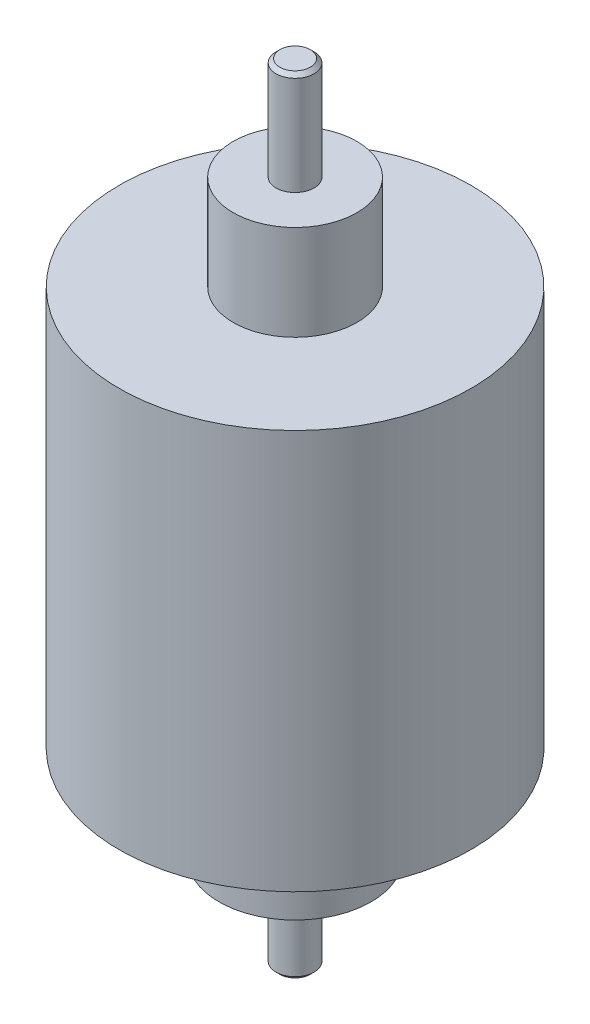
ISO-10303-21;
HEADER;
FILE_DESCRIPTION(('STEP AP214'),'2;1');
FILE_NAME('part.step','',(''),(''),'','','');
FILE_SCHEMA(('AUTOMOTIVE_DESIGN { 1 0 10303 214 1 1 1 1 }'));
ENDSEC;
DATA;
#1=APPLICATION_CONTEXT('core data for automotive mechanical design processes');
#2=APPLICATION_PROTOCOL_DEFINITION('international standard','automotive_design',2000,#1);
#3=PRODUCT_CONTEXT('',#1,'mechanical');
#4=PRODUCT('Part','Part','',(#3));
#5=PRODUCT_RELATED_PRODUCT_CATEGORY('part','',(#4));
#6=PRODUCT_DEFINITION_FORMATION('','',#4);
#7=PRODUCT_DEFINITION_CONTEXT('part definition',#1,'design');
#8=PRODUCT_DEFINITION('design','',#6,#7);
#9=PRODUCT_DEFINITION_SHAPE('','',#8);
#10=(LENGTH_UNIT() NAMED_UNIT(*) SI_UNIT(.MILLI.,.METRE.));
#11=(NAMED_UNIT(*) PLANE_ANGLE_UNIT() SI_UNIT($,.RADIAN.));
#12=(NAMED_UNIT(*) SI_UNIT($,.STERADIAN.) SOLID_ANGLE_UNIT());
#13=UNCERTAINTY_MEASURE_WITH_UNIT(LENGTH_MEASURE(1.E-05),#10,'distance_accuracy_value','');
#14=(GEOMETRIC_REPRESENTATION_CONTEXT(3) GLOBAL_UNCERTAINTY_ASSIGNED_CONTEXT((#13)) GLOBAL_UNIT_ASSIGNED_CONTEXT((#10,
#11,#12)) REPRESENTATION_CONTEXT('',''));
#15=CARTESIAN_POINT('',(0.,0.,0.));
#16=DIRECTION('',(0.,0.,1.));
#17=DIRECTION('',(1.,0.,0.));
#18=AXIS2_PLACEMENT_3D('',#15,#16,#17);
#19=CARTESIAN_POINT('',(0.,29.9994124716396,0.999999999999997));
#20=DIRECTION('',(0.,1.,0.));
#21=DIRECTION('',(0.,0.,1.));
#22=AXIS2_PLACEMENT_3D('',#19,#20,#21);
#23=PLANE('',#22);
#24=CARTESIAN_POINT('',(0.,29.9994124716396,0.));
#25=DIRECTION('',(0.,-1.,0.));
#26=DIRECTION('',(0.,0.,-1.));
#27=AXIS2_PLACEMENT_3D('',#24,#25,#26);
#28=CIRCLE('',#27,0.999999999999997);
#29=CARTESIAN_POINT('',(0.,29.9994124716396,-0.999999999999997));
#30=VERTEX_POINT('',#29);
#31=EDGE_CURVE('E52',#30,#30,#28,.T.);
#32=ORIENTED_EDGE('',*,*,#31,.T.);
#33=EDGE_LOOP('',(#32));
#34=FACE_BOUND('',#33,.T.);
#35=CARTESIAN_POINT('',(0.,29.9994124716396,0.));
#36=DIRECTION('',(0.,-1.,0.));
#37=DIRECTION('',(0.,0.,-1.));
#38=AXIS2_PLACEMENT_3D('',#35,#36,#37);
#39=CIRCLE('',#38,3.25);
#40=CARTESIAN_POINT('',(0.,29.9994124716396,-3.25));
#41=VERTEX_POINT('',#40);
#42=EDGE_CURVE('E83',#41,#41,#39,.T.);
#43=ORIENTED_EDGE('',*,*,#42,.F.);
#44=EDGE_LOOP('',(#43));
#45=FACE_BOUND('',#44,.T.);
#46=ADVANCED_FACE('F36',(#34,#45),#23,.T.);
#47=CARTESIAN_POINT('',(0.,-1.0005875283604,4.));
#48=DIRECTION('',(0.,-1.,0.));
#49=DIRECTION('',(0.,0.,-1.));
#50=AXIS2_PLACEMENT_3D('',#47,#48,#49);
#51=PLANE('',#50);
#52=CARTESIAN_POINT('',(0.,-1.0005875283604,0.));
#53=DIRECTION('',(0.,-1.,0.));
#54=DIRECTION('',(0.,0.,-1.));
#55=AXIS2_PLACEMENT_3D('',#52,#53,#54);
#56=CIRCLE('',#55,4.);
#57=CARTESIAN_POINT('',(0.,-1.0005875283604,-4.));
#58=VERTEX_POINT('',#57);
#59=EDGE_CURVE('E65',#58,#58,#56,.T.);
#60=ORIENTED_EDGE('',*,*,#59,.T.);
#61=EDGE_LOOP('',(#60));
#62=FACE_BOUND('',#61,.T.);
#63=CARTESIAN_POINT('',(0.,-1.0005875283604,0.));
#64=DIRECTION('',(0.,-1.,0.));
#65=DIRECTION('',(0.,0.,-1.));
#66=AXIS2_PLACEMENT_3D('',#63,#64,#65);
#67=CIRCLE('',#66,0.999999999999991);
#68=CARTESIAN_POINT('',(0.,-1.0005875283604,-0.999999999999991));
#69=VERTEX_POINT('',#68);
#70=EDGE_CURVE('E61',#69,#69,#67,.T.);
#71=ORIENTED_EDGE('',*,*,#70,.F.);
#72=EDGE_LOOP('',(#71));
#73=FACE_BOUND('',#72,.T.);
#74=ADVANCED_FACE('F91',(#62,#73),#51,.T.);
#75=CARTESIAN_POINT('',(0.,0.,0.));
#76=DIRECTION('',(0.,-1.,0.));
#77=DIRECTION('',(0.,0.,-1.));
#78=AXIS2_PLACEMENT_3D('',#75,#76,#77);
#79=CYLINDRICAL_SURFACE('',#78,4.);
#80=CARTESIAN_POINT('',(0.,3.9994124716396,0.));
#81=DIRECTION('',(0.,-1.,0.));
#82=DIRECTION('',(0.,0.,-1.));
#83=AXIS2_PLACEMENT_3D('',#80,#81,#82);
#84=CIRCLE('',#83,4.);
#85=CARTESIAN_POINT('',(0.,3.9994124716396,-4.));
#86=VERTEX_POINT('',#85);
#87=EDGE_CURVE('E69',#86,#86,#84,.T.);
#88=ORIENTED_EDGE('',*,*,#87,.T.);
#89=EDGE_LOOP('',(#88));
#90=FACE_BOUND('',#89,.T.);
#91=ORIENTED_EDGE('',*,*,#59,.F.);
#92=EDGE_LOOP('',(#91));
#93=FACE_BOUND('',#92,.T.);
#94=ADVANCED_FACE('F96',(#90,#93),#79,.T.);
#95=CARTESIAN_POINT('',(0.,3.9994124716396,9.25));
#96=DIRECTION('',(0.,-1.,0.));
#97=DIRECTION('',(0.,0.,-1.));
#98=AXIS2_PLACEMENT_3D('',#95,#96,#97);
#99=PLANE('',#98);
#100=CARTESIAN_POINT('',(0.,3.9994124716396,0.));
#101=DIRECTION('',(0.,-1.,0.));
#102=DIRECTION('',(0.,0.,-1.));
#103=AXIS2_PLACEMENT_3D('',#100,#101,#102);
#104=CIRCLE('',#103,9.25);
#105=CARTESIAN_POINT('',(0.,3.9994124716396,-9.25));
#106=VERTEX_POINT('',#105);
#107=EDGE_CURVE('E74',#106,#106,#104,.T.);
#108=ORIENTED_EDGE('',*,*,#107,.T.);
#109=EDGE_LOOP('',(#108));
#110=FACE_BOUND('',#109,.T.);
#111=ORIENTED_EDGE('',*,*,#87,.F.);
#112=EDGE_LOOP('',(#111));
#113=FACE_BOUND('',#112,.T.);
#114=ADVANCED_FACE('F130',(#110,#113),#99,.T.);
#115=CARTESIAN_POINT('',(0.,0.,0.));
#116=DIRECTION('',(0.,-1.,0.));
#117=DIRECTION('',(0.,0.,-1.));
#118=AXIS2_PLACEMENT_3D('',#115,#116,#117);
#119=CYLINDRICAL_SURFACE('',#118,9.25);
#120=CARTESIAN_POINT('',(0.,24.9994124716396,0.));
#121=DIRECTION('',(0.,-1.,0.));
#122=DIRECTION('',(0.,0.,-1.));
#123=AXIS2_PLACEMENT_3D('',#120,#121,#122);
#124=CIRCLE('',#123,9.25);
#125=CARTESIAN_POINT('',(0.,24.9994124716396,-9.25));
#126=VERTEX_POINT('',#125);
#127=EDGE_CURVE('E77',#126,#126,#124,.T.);
#128=ORIENTED_EDGE('',*,*,#127,.T.);
#129=EDGE_LOOP('',(#128));
#130=FACE_BOUND('',#129,.T.);
#131=ORIENTED_EDGE('',*,*,#107,.F.);
#132=EDGE_LOOP('',(#131));
#133=FACE_BOUND('',#132,.T.);
#134=ADVANCED_FACE('F124',(#130,#133),#119,.T.);
#135=CARTESIAN_POINT('',(0.,24.9994124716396,3.25));
#136=DIRECTION('',(0.,1.,0.));
#137=DIRECTION('',(0.,0.,1.));
#138=AXIS2_PLACEMENT_3D('',#135,#136,#137);
#139=PLANE('',#138);
#140=CARTESIAN_POINT('',(0.,24.9994124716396,0.));
#141=DIRECTION('',(0.,-1.,0.));
#142=DIRECTION('',(0.,0.,-1.));
#143=AXIS2_PLACEMENT_3D('',#140,#141,#142);
#144=CIRCLE('',#143,3.25);
#145=CARTESIAN_POINT('',(0.,24.9994124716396,-3.25));
#146=VERTEX_POINT('',#145);
#147=EDGE_CURVE('E80',#146,#146,#144,.T.);
#148=ORIENTED_EDGE('',*,*,#147,.T.);
#149=EDGE_LOOP('',(#148));
#150=FACE_BOUND('',#149,.T.);
#151=ORIENTED_EDGE('',*,*,#127,.F.);
#152=EDGE_LOOP('',(#151));
#153=FACE_BOUND('',#152,.T.);
#154=ADVANCED_FACE('F117',(#150,#153),#139,.T.);
#155=CARTESIAN_POINT('',(0.,0.,0.));
#156=DIRECTION('',(0.,-1.,0.));
#157=DIRECTION('',(0.,0.,-1.));
#158=AXIS2_PLACEMENT_3D('',#155,#156,#157);
#159=CYLINDRICAL_SURFACE('',#158,3.25);
#160=ORIENTED_EDGE('',*,*,#42,.T.);
#161=EDGE_LOOP('',(#160));
#162=FACE_BOUND('',#161,.T.);
#163=ORIENTED_EDGE('',*,*,#147,.F.);
#164=EDGE_LOOP('',(#163));
#165=FACE_BOUND('',#164,.T.);
#166=ADVANCED_FACE('F87',(#162,#165),#159,.T.);
#167=CARTESIAN_POINT('',(0.,-5.9,0.));
#168=DIRECTION('',(0.,-1.,0.));
#169=DIRECTION('',(0.,0.,-1.));
#170=AXIS2_PLACEMENT_3D('',#167,#168,#169);
#171=PLANE('',#170);
#172=CARTESIAN_POINT('',(0.,-5.89999999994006,0.));
#173=DIRECTION('',(0.,1.,0.));
#174=DIRECTION('',(0.,0.,1.));
#175=AXIS2_PLACEMENT_3D('',#172,#173,#174);
#176=CIRCLE('',#175,0.800000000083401);
#177=CARTESIAN_POINT('',(0.,-5.89999999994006,0.800000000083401));
#178=VERTEX_POINT('',#177);
#179=EDGE_CURVE('E44',#178,#178,#176,.T.);
#180=ORIENTED_EDGE('',*,*,#179,.F.);
#181=EDGE_LOOP('',(#180));
#182=FACE_BOUND('',#181,.T.);
#183=ADVANCED_FACE('F108',(#182),#171,.T.);
#184=CARTESIAN_POINT('',(0.,-5.70000000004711,0.));
#185=DIRECTION('',(0.,1.,0.));
#186=DIRECTION('',(0.,0.,1.));
#187=AXIS2_PLACEMENT_3D('',#184,#185,#186);
#188=CONICAL_SURFACE('',#187,1.0000000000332,0.785398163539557);
#189=ORIENTED_EDGE('',*,*,#179,.T.);
#190=EDGE_LOOP('',(#189));
#191=FACE_BOUND('',#190,.T.);
#192=CARTESIAN_POINT('',(0.,-5.7,0.));
#193=DIRECTION('',(0.,1.,0.));
#194=DIRECTION('',(0.,0.,1.));
#195=AXIS2_PLACEMENT_3D('',#192,#193,#194);
#196=CIRCLE('',#195,1.);
#197=CARTESIAN_POINT('',(0.,-5.7,1.));
#198=VERTEX_POINT('',#197);
#199=EDGE_CURVE('E10',#198,#198,#196,.T.);
#200=ORIENTED_EDGE('',*,*,#199,.F.);
#201=EDGE_LOOP('',(#200));
#202=FACE_BOUND('',#201,.T.);
#203=ADVANCED_FACE('F105',(#191,#202),#188,.T.);
#204=CARTESIAN_POINT('',(0.,-5.9,0.));
#205=DIRECTION('',(0.,1.,0.));
#206=DIRECTION('',(0.,0.,1.));
#207=AXIS2_PLACEMENT_3D('',#204,#205,#206);
#208=CYLINDRICAL_SURFACE('',#207,1.);
#209=ORIENTED_EDGE('',*,*,#199,.T.);
#210=EDGE_LOOP('',(#209));
#211=FACE_BOUND('',#210,.T.);
#212=ORIENTED_EDGE('',*,*,#70,.T.);
#213=EDGE_LOOP('',(#212));
#214=FACE_BOUND('',#213,.T.);
#215=ADVANCED_FACE('F102',(#211,#214),#208,.T.);
#216=CARTESIAN_POINT('',(0.,35.2000000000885,0.));
#217=DIRECTION('',(0.,-1.,0.));
#218=DIRECTION('',(0.,0.,-1.));
#219=AXIS2_PLACEMENT_3D('',#216,#217,#218);
#220=CONICAL_SURFACE('',#219,0.99999999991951,0.785398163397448);
#221=CARTESIAN_POINT('',(0.,35.2,0.));
#222=DIRECTION('',(0.,-1.,0.));
#223=DIRECTION('',(0.,0.,-1.));
#224=AXIS2_PLACEMENT_3D('',#221,#222,#223);
#225=CIRCLE('',#224,1.);
#226=CARTESIAN_POINT('',(0.,35.2,-1.));
#227=VERTEX_POINT('',#226);
#228=EDGE_CURVE('E49',#227,#227,#225,.T.);
#229=ORIENTED_EDGE('',*,*,#228,.F.);
#230=EDGE_LOOP('',(#229));
#231=FACE_BOUND('',#230,.T.);
#232=CARTESIAN_POINT('',(0.,35.3994124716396,0.));
#233=DIRECTION('',(0.,1.,0.));
#234=DIRECTION('',(0.,0.,1.));
#235=AXIS2_PLACEMENT_3D('',#232,#233,#234);
#236=CIRCLE('',#235,0.800587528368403);
#237=CARTESIAN_POINT('',(0.,35.3994124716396,0.800587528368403));
#238=VERTEX_POINT('',#237);
#239=EDGE_CURVE('E40',#238,#238,#236,.F.);
#240=ORIENTED_EDGE('',*,*,#239,.T.);
#241=EDGE_LOOP('',(#240));
#242=FACE_BOUND('',#241,.T.);
#243=ADVANCED_FACE('F38',(#231,#242),#220,.T.);
#244=CARTESIAN_POINT('',(0.,35.4,0.));
#245=DIRECTION('',(0.,-1.,0.));
#246=DIRECTION('',(0.,0.,-1.));
#247=AXIS2_PLACEMENT_3D('',#244,#245,#246);
#248=CYLINDRICAL_SURFACE('',#247,1.);
#249=ORIENTED_EDGE('',*,*,#228,.T.);
#250=EDGE_LOOP('',(#249));
#251=FACE_BOUND('',#250,.T.);
#252=ORIENTED_EDGE('',*,*,#31,.F.);
#253=EDGE_LOOP('',(#252));
#254=FACE_BOUND('',#253,.T.);
#255=ADVANCED_FACE('F110',(#251,#254),#248,.T.);
#256=CARTESIAN_POINT('',(0.,35.3994124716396,0.999999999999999));
#257=DIRECTION('',(0.,1.,0.));
#258=DIRECTION('',(0.,0.,1.));
#259=AXIS2_PLACEMENT_3D('',#256,#257,#258);
#260=PLANE('',#259);
#261=ORIENTED_EDGE('',*,*,#239,.F.);
#262=EDGE_LOOP('',(#261));
#263=FACE_BOUND('',#262,.T.);
#264=ADVANCED_FACE('F101',(#263),#260,.T.);
#265=CLOSED_SHELL('',(#46,#74,#94,#114,#134,#154,#166,#183,#203,#215,#243,#255,#264));
#266=MANIFOLD_SOLID_BREP('B2',#265);
#267=ADVANCED_BREP_SHAPE_REPRESENTATION('',(#18,#266),#14);
#268=SHAPE_DEFINITION_REPRESENTATION(#9,#267);
ENDSEC;
END-ISO-10303-21;
